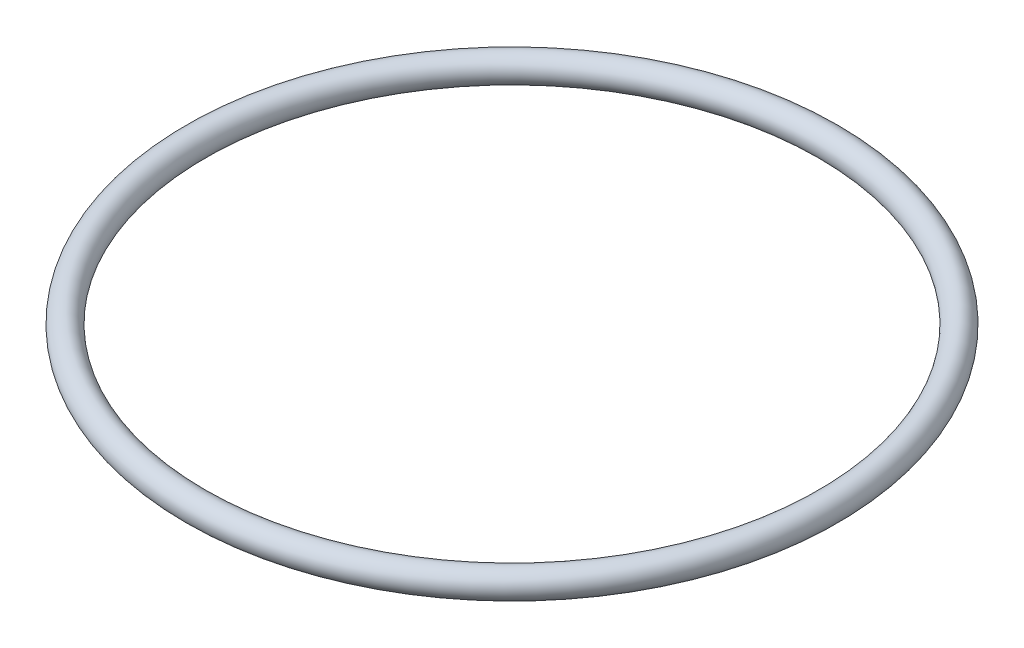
ISO-10303-21;
HEADER;
FILE_DESCRIPTION(('STEP AP214'),'2;1');
FILE_NAME('part.step','',(''),(''),'','','');
FILE_SCHEMA(('AUTOMOTIVE_DESIGN { 1 0 10303 214 1 1 1 1 }'));
ENDSEC;
DATA;
#1=APPLICATION_CONTEXT('core data for automotive mechanical design processes');
#2=APPLICATION_PROTOCOL_DEFINITION('international standard','automotive_design',2000,#1);
#3=PRODUCT_CONTEXT('',#1,'mechanical');
#4=PRODUCT('Part','Part','',(#3));
#5=PRODUCT_RELATED_PRODUCT_CATEGORY('part','',(#4));
#6=PRODUCT_DEFINITION_FORMATION('','',#4);
#7=PRODUCT_DEFINITION_CONTEXT('part definition',#1,'design');
#8=PRODUCT_DEFINITION('design','',#6,#7);
#9=PRODUCT_DEFINITION_SHAPE('','',#8);
#10=(LENGTH_UNIT() NAMED_UNIT(*) SI_UNIT(.MILLI.,.METRE.));
#11=(NAMED_UNIT(*) PLANE_ANGLE_UNIT() SI_UNIT($,.RADIAN.));
#12=(NAMED_UNIT(*) SI_UNIT($,.STERADIAN.) SOLID_ANGLE_UNIT());
#13=UNCERTAINTY_MEASURE_WITH_UNIT(LENGTH_MEASURE(1.E-05),#10,'distance_accuracy_value','');
#14=(GEOMETRIC_REPRESENTATION_CONTEXT(3) GLOBAL_UNCERTAINTY_ASSIGNED_CONTEXT((#13)) GLOBAL_UNIT_ASSIGNED_CONTEXT((#10,
#11,#12)) REPRESENTATION_CONTEXT('',''));
#15=CARTESIAN_POINT('',(0.,0.,0.));
#16=DIRECTION('',(0.,0.,1.));
#17=DIRECTION('',(1.,0.,0.));
#18=AXIS2_PLACEMENT_3D('',#15,#16,#17);
#19=CARTESIAN_POINT('',(0.,0.,0.));
#20=DIRECTION('',(0.,-1.,0.));
#21=DIRECTION('',(0.,0.,-0.999999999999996));
#22=AXIS2_PLACEMENT_3D('',#19,#20,#21);
#23=TOROIDAL_SURFACE('',#22,62.6745,2.667);
#24=CARTESIAN_POINT('',(0.,0.,-65.3414999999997));
#25=VERTEX_POINT('',#24);
#26=VERTEX_LOOP('',#25);
#27=FACE_BOUND('',#26,.T.);
#28=ADVANCED_FACE('F26',(#27),#23,.T.);
#29=CLOSED_SHELL('',(#28));
#30=MANIFOLD_SOLID_BREP('B2',#29);
#31=ADVANCED_BREP_SHAPE_REPRESENTATION('',(#18,#30),#14);
#32=SHAPE_DEFINITION_REPRESENTATION(#9,#31);
ENDSEC;
END-ISO-10303-21;
